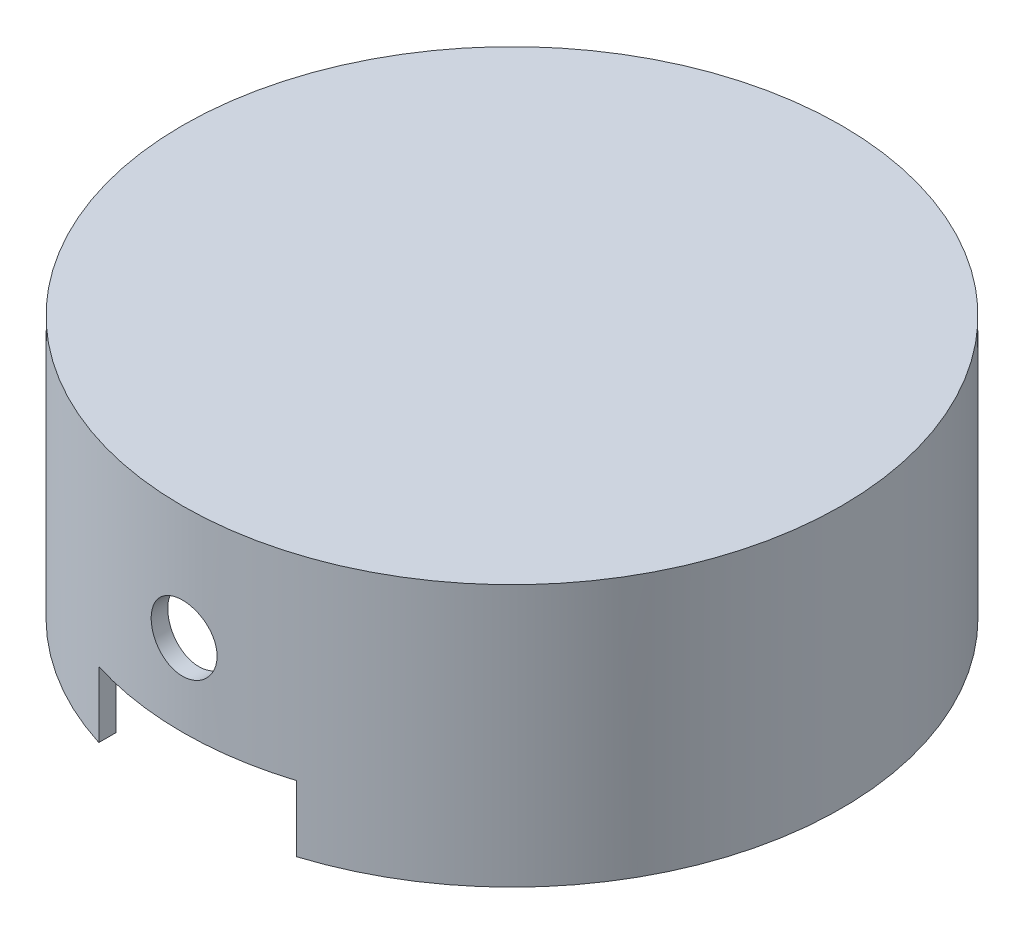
from build123d import *

# Parameters (mm, degrees)
SKETCH1_R           = 63.5
EXTRUDE1_DEPTH      = 50.4825
SHELL1_T            = -3.175
EXTRUDE2_DEPTH      = 104.019332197
EXTRUDE2_DEPTH_BACK = 104.019332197
SKETCH2_R           = 6.35
SKETCH2_W           = 38.1
SKETCH2_H           = 12.7


with BuildPart() as part:
    # Sketch1 → Extrude1 (new body)
    with BuildSketch(Plane(origin=(0, 0, 0), x_dir=(1, 0, 0), z_dir=(0, 1, 0))):
        with Locations(Location((0, 0, 0), (0, 0, 270))):
            Circle(SKETCH1_R)
    extrude(amount=-EXTRUDE1_DEPTH)

    # Shell1
    shell1_openings = [part.faces().sort_by_distance(p)[0] for p in [
        (0, -50.4825, 0),
    ]]
    offset(amount=SHELL1_T, openings=shell1_openings, kind=Kind.INTERSECTION)

    # Sketch2 → Extrude2 (cut, two sides: drawn at the far end of the back side and taken through both)
    with BuildSketch(Plane.XY.offset(-EXTRUDE2_DEPTH_BACK)):
        with Locations((0, -22.06625)):
            Circle(SKETCH2_R)
        with Locations((0, -44.1325)):
            Rectangle(SKETCH2_W, SKETCH2_H)
    extrude(amount=EXTRUDE2_DEPTH + EXTRUDE2_DEPTH_BACK, mode=Mode.SUBTRACT)


solid = part.part
